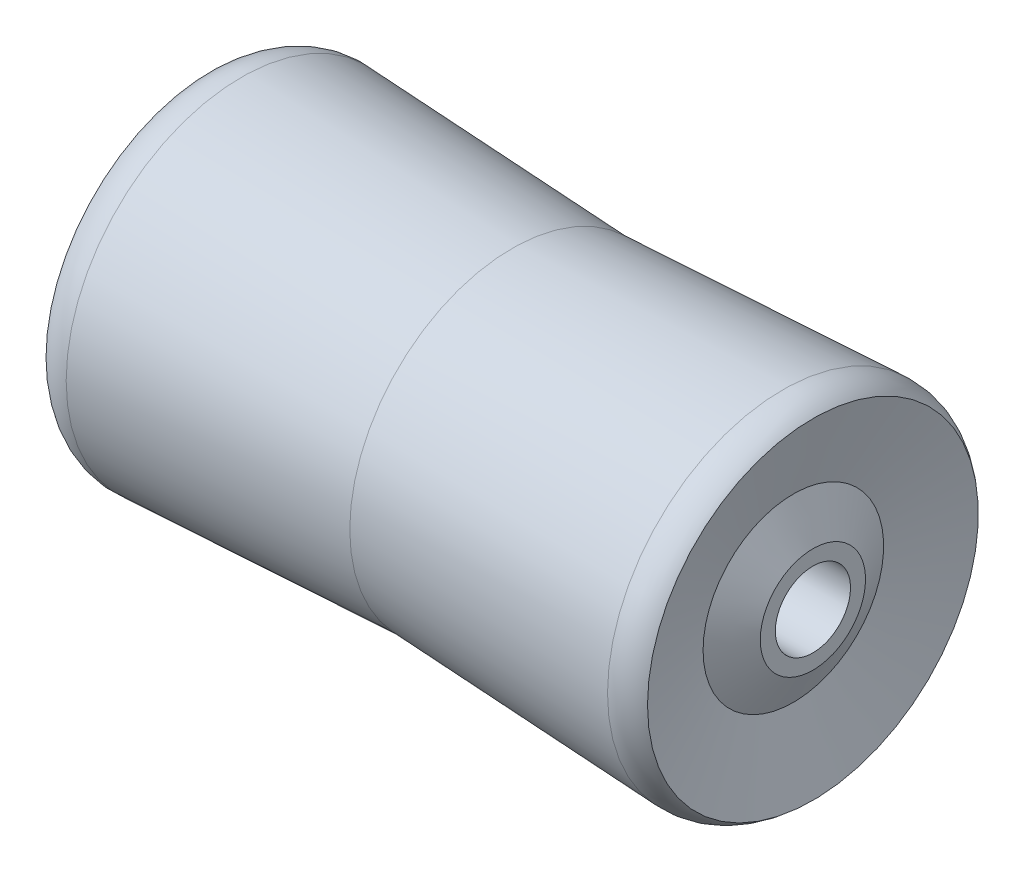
from build123d import *


with BuildPart() as part:
    # Esquisse1 → R_volution4 (revolve)
    with BuildSketch(Plane.XY, mode=Mode.PRIVATE) as r_volution4_sk:
        with BuildLine():
            ThreePointArc((-100, 55), (-95.34330204, 57.689244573), (-90, 58.294220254))
            ThreePointArc((-90, 58.294220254), (-45.048389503, 55.13294341), (0, 54))
            ThreePointArc((0, 54), (45.048389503, 55.13294341), (90, 58.294220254))
            ThreePointArc((90, 58.294220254), (95.34330204, 57.689244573), (100, 55))
            Line((100, 55), (93.5, 30.020113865))
            Line((93.5, 30.020113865), (100, 17.5))
            Line((100, 17.5), (100, 12.5))
            Line((100, 12.5), (-100, 12.5))
            Line((-100, 12.5), (-100, 17.5))
            Line((-100, 17.5), (-93.5, 30.020113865))
            Line((-93.5, 30.020113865), (-100, 55))
        make_face()
    revolve(r_volution4_sk.sketch.rotate(Axis((-100, 0, 0), (1, 0, 0)), 90), axis=Axis((-100, 0, 0), (1, 0, 0)))


solid = part.part
